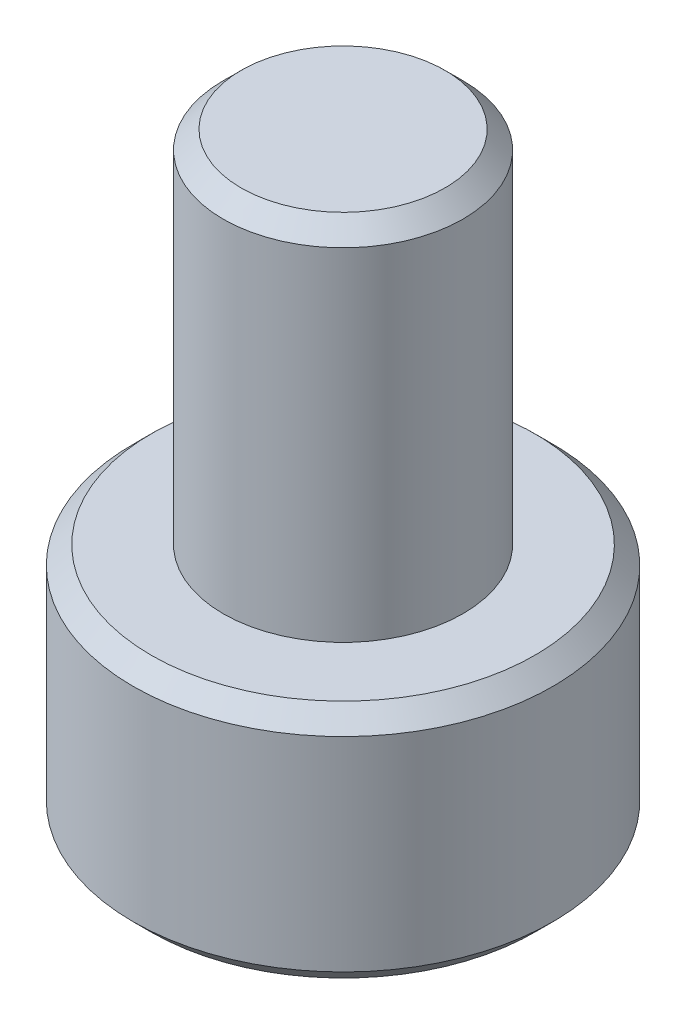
from build123d import *

# Parameters (mm, degrees)
SKETCH1_R           = 3.5
BOSS_EXTRUDE1_DEPTH = 4
SKETCH2_R           = 2
BOSS_EXTRUDE2_DEPTH = 6
CHAMFER1_SIZE       = 0.3
CHAMFER2_SIZE       = 0.3
CUT_EXTRUDE1_DEPTH  = 2


with BuildPart() as part:
    # Sketch1 → Boss-Extrude1 (new body)
    with BuildSketch(Plane(origin=(0, 0, 0), x_dir=(1, 0, 0), z_dir=(0, 1, 0))):
        with Locations(Location((0, 0, 0), (0, 0, 270))):
            Circle(SKETCH1_R)
    extrude(amount=BOSS_EXTRUDE1_DEPTH)

    # Sketch2 → Boss-Extrude2 (add)
    with BuildSketch(Plane(origin=(0, 4, 0), x_dir=(1, 0, 0), z_dir=(0, 1, 0))):
        with Locations(Location((0, 0, 0), (0, 0, 270))):
            Circle(SKETCH2_R)
    extrude(amount=BOSS_EXTRUDE2_DEPTH)

    # Chamfer1
    chamfer1_edges = [part.edges().sort_by_distance(p)[0] for p in [
        (0, 0, -3.5),
        (0, 4, -3.5),
    ]]
    chamfer(chamfer1_edges, length=CHAMFER1_SIZE)

    # Chamfer2
    chamfer2_edges = [part.edges().sort_by_distance(p)[0] for p in [
        (0, 10, -2),
    ]]
    chamfer(chamfer2_edges, length=CHAMFER2_SIZE)

    # Sketch3 → Cut-Extrude1 (cut)
    with BuildSketch(Plane.XZ):
        Polygon((1.772465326, 0), (0.886232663, 1.535), (-0.886232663, 1.535), (-1.772465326, 0), (-0.886232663, -1.535), (0.886232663, -1.535), align=None)
    extrude(amount=-CUT_EXTRUDE1_DEPTH, mode=Mode.SUBTRACT)


solid = part.part
